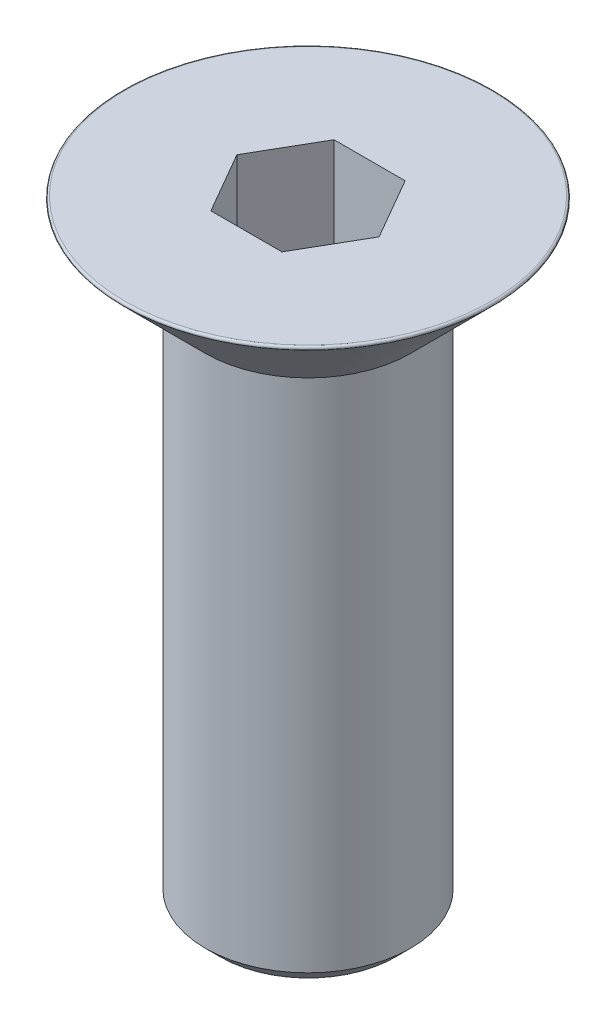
from build123d import *

# Parameters (mm, degrees)
ENL_V_MAT_EXTRU_1_DEPTH = 5
CHANFREIN1_SIZE         = 0.75
CONG_1_R                = 0.1


with BuildPart() as part:
    # Esquisse1 → Base-R_volution (revolve)
    with BuildSketch(Plane.XY, mode=Mode.PRIVATE) as base_r_volution_sk:
        Polygon((0, 0), (9.15, 0), (5, -4.15), (5, -30), (0, -30), align=None)
    revolve(base_r_volution_sk.sketch.rotate(Axis((0, 18.020251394, 0), (0, -1, 0)), 90), axis=Axis((0, 18.020251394, 0), (0, -1, 0)))

    # Esquisse2 → Enl_v. mat.-Extru.1 (cut)
    with BuildSketch(Plane(origin=(-0.418409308, 0, 2.094233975), x_dir=(-1, 0, 0), z_dir=(0, 1, 0))):
        Polygon((1.313641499, 0.905766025), (3.045692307, -2.094233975), (1.313641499, -5.094233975), (-2.150460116, -5.094233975), (-3.882510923, -2.094233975), (-2.150460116, 0.905766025), align=None)
    extrude(amount=-ENL_V_MAT_EXTRU_1_DEPTH, mode=Mode.SUBTRACT)

    # Chanfrein1
    chanfrein1_edges = [part.edges().sort_by_distance(p)[0] for p in [
        (0, -30, -5),
    ]]
    chamfer(chanfrein1_edges, length=CHANFREIN1_SIZE)

    # Cong_1
    cong_1_edges = [part.edges().sort_by_distance(p)[0] for p in [
        (0, 0, -9.15),
    ]]
    fillet(cong_1_edges, radius=CONG_1_R)


solid = part.part
